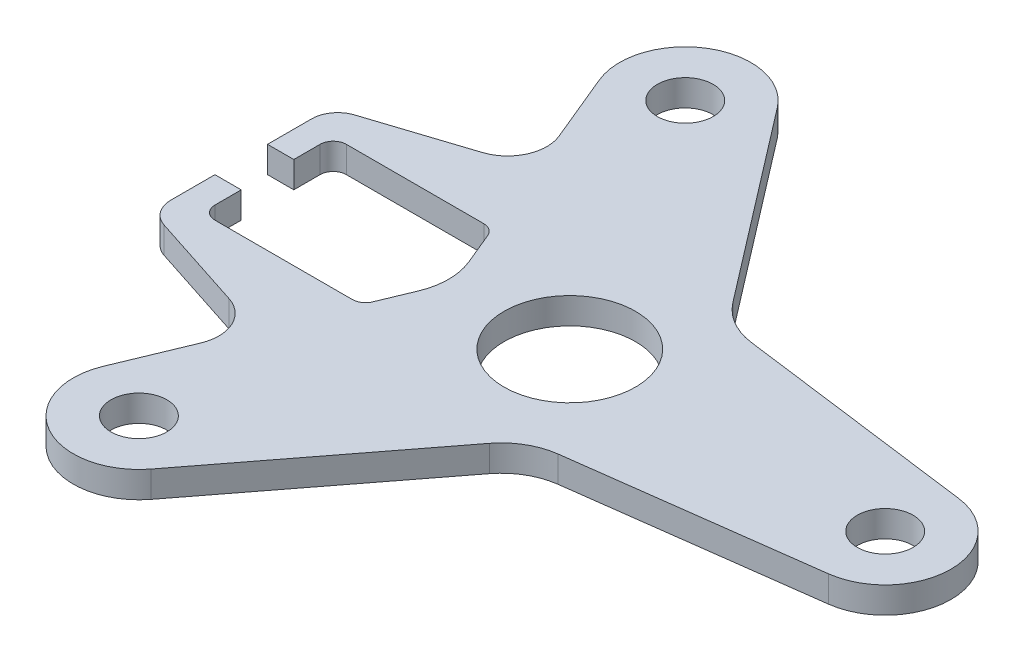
ISO-10303-21;
HEADER;
FILE_DESCRIPTION(('STEP AP214'),'2;1');
FILE_NAME('part.step','',(''),(''),'','','');
FILE_SCHEMA(('AUTOMOTIVE_DESIGN { 1 0 10303 214 1 1 1 1 }'));
ENDSEC;
DATA;
#1=APPLICATION_CONTEXT('core data for automotive mechanical design processes');
#2=APPLICATION_PROTOCOL_DEFINITION('international standard','automotive_design',2000,#1);
#3=PRODUCT_CONTEXT('',#1,'mechanical');
#4=PRODUCT('Part','Part','',(#3));
#5=PRODUCT_RELATED_PRODUCT_CATEGORY('part','',(#4));
#6=PRODUCT_DEFINITION_FORMATION('','',#4);
#7=PRODUCT_DEFINITION_CONTEXT('part definition',#1,'design');
#8=PRODUCT_DEFINITION('design','',#6,#7);
#9=PRODUCT_DEFINITION_SHAPE('','',#8);
#10=(LENGTH_UNIT() NAMED_UNIT(*) SI_UNIT(.MILLI.,.METRE.));
#11=(NAMED_UNIT(*) PLANE_ANGLE_UNIT() SI_UNIT($,.RADIAN.));
#12=(NAMED_UNIT(*) SI_UNIT($,.STERADIAN.) SOLID_ANGLE_UNIT());
#13=UNCERTAINTY_MEASURE_WITH_UNIT(LENGTH_MEASURE(1.E-05),#10,'distance_accuracy_value','');
#14=(GEOMETRIC_REPRESENTATION_CONTEXT(3) GLOBAL_UNCERTAINTY_ASSIGNED_CONTEXT((#13)) GLOBAL_UNIT_ASSIGNED_CONTEXT((#10,
#11,#12)) REPRESENTATION_CONTEXT('',''));
#15=CARTESIAN_POINT('',(0.,0.,0.));
#16=DIRECTION('',(0.,0.,1.));
#17=DIRECTION('',(1.,0.,0.));
#18=AXIS2_PLACEMENT_3D('',#15,#16,#17);
#19=CARTESIAN_POINT('',(7.10732739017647,1.,12.310252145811));
#20=DIRECTION('',(0.,1.,0.));
#21=DIRECTION('',(0.,0.,1.));
#22=AXIS2_PLACEMENT_3D('',#19,#20,#21);
#23=PLANE('',#22);
#24=CARTESIAN_POINT('',(-12.,1.,-20.7846096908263));
#25=DIRECTION('',(0.,1.,0.));
#26=DIRECTION('',(0.,0.,1.));
#27=AXIS2_PLACEMENT_3D('',#24,#25,#26);
#28=CIRCLE('',#27,2.12500000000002);
#29=CARTESIAN_POINT('',(-12.,1.,-18.6596096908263));
#30=VERTEX_POINT('',#29);
#31=EDGE_CURVE('E551',#30,#30,#28,.T.);
#32=ORIENTED_EDGE('',*,*,#31,.F.);
#33=EDGE_LOOP('',(#32));
#34=FACE_BOUND('',#33,.T.);
#35=CARTESIAN_POINT('',(24.,1.,0.));
#36=DIRECTION('',(0.,1.,0.));
#37=DIRECTION('',(0.,0.,1.));
#38=AXIS2_PLACEMENT_3D('',#35,#36,#37);
#39=CIRCLE('',#38,2.125);
#40=CARTESIAN_POINT('',(24.,1.,2.125));
#41=VERTEX_POINT('',#40);
#42=EDGE_CURVE('E277',#41,#41,#39,.T.);
#43=ORIENTED_EDGE('',*,*,#42,.F.);
#44=EDGE_LOOP('',(#43));
#45=FACE_BOUND('',#44,.T.);
#46=CARTESIAN_POINT('',(7.10732739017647,1.,12.310252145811));
#47=DIRECTION('',(0.,-1.,0.));
#48=DIRECTION('',(0.,0.,1.));
#49=AXIS2_PLACEMENT_3D('',#46,#47,#48);
#50=CIRCLE('',#49,5.);
#51=CARTESIAN_POINT('',(3.14056068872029,1.,9.26644500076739));
#52=VERTEX_POINT('',#51);
#53=CARTESIAN_POINT('',(6.45469642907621,1.,7.35302783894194));
#54=VERTEX_POINT('',#53);
#55=EDGE_CURVE('E336',#52,#54,#50,.T.);
#56=ORIENTED_EDGE('',*,*,#55,.T.);
#57=DIRECTION('',(0.99144486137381,0.,-0.130526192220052));
#58=VECTOR('',#57,1.);
#59=CARTESIAN_POINT('',(24.6526309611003,1.,4.95722430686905));
#60=LINE('',#59,#58);
#61=CARTESIAN_POINT('',(24.6526309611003,1.,4.95722430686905));
#62=VERTEX_POINT('',#61);
#63=EDGE_CURVE('E164',#54,#62,#60,.T.);
#64=ORIENTED_EDGE('',*,*,#63,.T.);
#65=CARTESIAN_POINT('',(24.,1.,0.));
#66=DIRECTION('',(0.,1.,0.));
#67=DIRECTION('',(0.,0.,1.));
#68=AXIS2_PLACEMENT_3D('',#65,#66,#67);
#69=CIRCLE('',#68,5.);
#70=CARTESIAN_POINT('',(24.6526309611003,1.,-4.95722430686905));
#71=VERTEX_POINT('',#70);
#72=EDGE_CURVE('E423',#62,#71,#69,.T.);
#73=ORIENTED_EDGE('',*,*,#72,.T.);
#74=DIRECTION('',(-0.99144486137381,0.,-0.130526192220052));
#75=VECTOR('',#74,1.);
#76=CARTESIAN_POINT('',(24.6526309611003,1.,-4.95722430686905));
#77=LINE('',#76,#75);
#78=CARTESIAN_POINT('',(6.45469642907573,1.,-7.353027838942));
#79=VERTEX_POINT('',#78);
#80=EDGE_CURVE('E442',#71,#79,#77,.T.);
#81=ORIENTED_EDGE('',*,*,#80,.T.);
#82=CARTESIAN_POINT('',(7.10732739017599,1.,-12.3102521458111));
#83=DIRECTION('',(0.,-1.,0.));
#84=DIRECTION('',(0.,0.,1.));
#85=AXIS2_PLACEMENT_3D('',#82,#83,#84);
#86=CIRCLE('',#85,5.);
#87=CARTESIAN_POINT('',(3.14056068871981,1.,-9.26644500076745));
#88=VERTEX_POINT('',#87);
#89=EDGE_CURVE('E439',#79,#88,#86,.T.);
#90=ORIENTED_EDGE('',*,*,#89,.T.);
#91=DIRECTION('',(-0.608761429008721,0.,-0.793353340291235));
#92=VECTOR('',#91,1.);
#93=CARTESIAN_POINT('',(-8.03323329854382,1.,-23.8284168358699));
#94=LINE('',#93,#92);
#95=CARTESIAN_POINT('',(-8.03323329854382,1.,-23.8284168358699));
#96=VERTEX_POINT('',#95);
#97=EDGE_CURVE('E441',#88,#96,#94,.T.);
#98=ORIENTED_EDGE('',*,*,#97,.T.);
#99=CARTESIAN_POINT('',(-12.,1.,-20.7846096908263));
#100=DIRECTION('',(0.,1.,0.));
#101=DIRECTION('',(0.,0.,1.));
#102=AXIS2_PLACEMENT_3D('',#99,#100,#101);
#103=CIRCLE('',#102,5.);
#104=CARTESIAN_POINT('',(-16.6193976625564,1.,-18.8711925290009));
#105=VERTEX_POINT('',#104);
#106=EDGE_CURVE('E444',#96,#105,#103,.T.);
#107=ORIENTED_EDGE('',*,*,#106,.T.);
#108=DIRECTION('',(0.382683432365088,0.,0.923879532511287));
#109=VECTOR('',#108,1.);
#110=CARTESIAN_POINT('',(-16.6193976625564,1.,-18.8711925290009));
#111=LINE('',#110,#109);
#112=CARTESIAN_POINT('',(-14.4493554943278,1.,-13.6322472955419));
#113=VERTEX_POINT('',#112);
#114=EDGE_CURVE('E450',#105,#113,#111,.T.);
#115=ORIENTED_EDGE('',*,*,#114,.T.);
#116=CARTESIAN_POINT('',(-17.2209940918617,1.,-12.4841969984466));
#117=DIRECTION('',(0.,-1.,0.));
#118=DIRECTION('',(0.,0.,1.));
#119=AXIS2_PLACEMENT_3D('',#116,#117,#118);
#120=CIRCLE('',#119,3.);
#121=CARTESIAN_POINT('',(-16.2939431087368,1.,-9.63102744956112));
#122=VERTEX_POINT('',#121);
#123=EDGE_CURVE('E452',#113,#122,#120,.T.);
#124=ORIENTED_EDGE('',*,*,#123,.T.);
#125=DIRECTION('',(-0.951056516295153,0.,0.309016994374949));
#126=VECTOR('',#125,1.);
#127=CARTESIAN_POINT('',(-23.6180339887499,1.,-7.25128606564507));
#128=LINE('',#127,#126);
#129=CARTESIAN_POINT('',(-23.6180339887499,1.,-7.25128606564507));
#130=VERTEX_POINT('',#129);
#131=EDGE_CURVE('E454',#122,#130,#128,.T.);
#132=ORIENTED_EDGE('',*,*,#131,.T.);
#133=CARTESIAN_POINT('',(-23.,1.,-5.34917303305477));
#134=DIRECTION('',(0.,1.,0.));
#135=DIRECTION('',(0.,0.,1.));
#136=AXIS2_PLACEMENT_3D('',#133,#134,#135);
#137=CIRCLE('',#136,2.);
#138=CARTESIAN_POINT('',(-25.,1.,-5.34917303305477));
#139=VERTEX_POINT('',#138);
#140=EDGE_CURVE('E456',#130,#139,#137,.T.);
#141=ORIENTED_EDGE('',*,*,#140,.T.);
#142=DIRECTION('',(0.,0.,1.));
#143=VECTOR('',#142,1.);
#144=CARTESIAN_POINT('',(-25.,1.,-5.34917303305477));
#145=LINE('',#144,#143);
#146=CARTESIAN_POINT('',(-25.,1.,-2.));
#147=VERTEX_POINT('',#146);
#148=EDGE_CURVE('E458',#139,#147,#145,.T.);
#149=ORIENTED_EDGE('',*,*,#148,.T.);
#150=DIRECTION('',(1.,0.,0.));
#151=VECTOR('',#150,1.);
#152=CARTESIAN_POINT('',(-25.,1.,-2.));
#153=LINE('',#152,#151);
#154=CARTESIAN_POINT('',(-23.,1.,-2.));
#155=VERTEX_POINT('',#154);
#156=EDGE_CURVE('E460',#147,#155,#153,.T.);
#157=ORIENTED_EDGE('',*,*,#156,.T.);
#158=DIRECTION('',(0.,0.,-1.));
#159=VECTOR('',#158,1.);
#160=CARTESIAN_POINT('',(-23.,1.,-3.99999999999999));
#161=LINE('',#160,#159);
#162=CARTESIAN_POINT('',(-23.,1.,-3.99999999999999));
#163=VERTEX_POINT('',#162);
#164=EDGE_CURVE('E462',#155,#163,#161,.T.);
#165=ORIENTED_EDGE('',*,*,#164,.T.);
#166=CARTESIAN_POINT('',(-22.,1.,-4.));
#167=DIRECTION('',(0.,-1.,0.));
#168=DIRECTION('',(0.,0.,1.));
#169=AXIS2_PLACEMENT_3D('',#166,#167,#168);
#170=CIRCLE('',#169,1.);
#171=CARTESIAN_POINT('',(-22.,1.,-5.));
#172=VERTEX_POINT('',#171);
#173=EDGE_CURVE('E464',#163,#172,#170,.T.);
#174=ORIENTED_EDGE('',*,*,#173,.T.);
#175=DIRECTION('',(1.,0.,0.));
#176=VECTOR('',#175,1.);
#177=CARTESIAN_POINT('',(-22.,1.,-5.));
#178=LINE('',#177,#176);
#179=CARTESIAN_POINT('',(-11.5419402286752,1.,-5.));
#180=VERTEX_POINT('',#179);
#181=EDGE_CURVE('E466',#172,#180,#178,.T.);
#182=ORIENTED_EDGE('',*,*,#181,.T.);
#183=CARTESIAN_POINT('',(-11.5419402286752,1.,-4.));
#184=DIRECTION('',(0.,-1.,0.));
#185=DIRECTION('',(0.,0.,-1.));
#186=AXIS2_PLACEMENT_3D('',#183,#184,#185);
#187=CIRCLE('',#186,1.);
#188=CARTESIAN_POINT('',(-10.6180606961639,1.,-4.38268343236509));
#189=VERTEX_POINT('',#188);
#190=EDGE_CURVE('E468',#180,#189,#187,.T.);
#191=ORIENTED_EDGE('',*,*,#190,.T.);
#192=DIRECTION('',(0.382683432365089,0.,0.923879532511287));
#193=VECTOR('',#192,1.);
#194=CARTESIAN_POINT('',(-10.6180606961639,1.,-4.38268343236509));
#195=LINE('',#194,#193);
#196=CARTESIAN_POINT('',(-9.59525711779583,1.,-1.91341716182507));
#197=VERTEX_POINT('',#196);
#198=EDGE_CURVE('E470',#189,#197,#195,.T.);
#199=ORIENTED_EDGE('',*,*,#198,.T.);
#200=CARTESIAN_POINT('',(-14.2146547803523,1.,3.85108611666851E-13));
#201=DIRECTION('',(0.,-1.,0.));
#202=DIRECTION('',(0.,0.,1.));
#203=AXIS2_PLACEMENT_3D('',#200,#201,#202);
#204=CIRCLE('',#203,5.);
#205=CARTESIAN_POINT('',(-9.59525711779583,1.,1.91341716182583));
#206=VERTEX_POINT('',#205);
#207=EDGE_CURVE('E472',#197,#206,#204,.T.);
#208=ORIENTED_EDGE('',*,*,#207,.T.);
#209=DIRECTION('',(-0.382683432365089,0.,0.923879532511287));
#210=VECTOR('',#209,1.);
#211=CARTESIAN_POINT('',(-10.6180606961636,1.,4.38268343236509));
#212=LINE('',#211,#210);
#213=CARTESIAN_POINT('',(-10.6180606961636,1.,4.38268343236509));
#214=VERTEX_POINT('',#213);
#215=EDGE_CURVE('E474',#206,#214,#212,.T.);
#216=ORIENTED_EDGE('',*,*,#215,.T.);
#217=CARTESIAN_POINT('',(-11.5419402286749,1.,4.));
#218=DIRECTION('',(0.,-1.,0.));
#219=DIRECTION('',(0.,0.,-1.));
#220=AXIS2_PLACEMENT_3D('',#217,#218,#219);
#221=CIRCLE('',#220,1.);
#222=CARTESIAN_POINT('',(-11.5419402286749,1.,5.));
#223=VERTEX_POINT('',#222);
#224=EDGE_CURVE('E476',#214,#223,#221,.T.);
#225=ORIENTED_EDGE('',*,*,#224,.T.);
#226=DIRECTION('',(-1.,0.,0.));
#227=VECTOR('',#226,1.);
#228=CARTESIAN_POINT('',(-22.,1.,5.));
#229=LINE('',#228,#227);
#230=CARTESIAN_POINT('',(-22.,1.,5.));
#231=VERTEX_POINT('',#230);
#232=EDGE_CURVE('E478',#223,#231,#229,.T.);
#233=ORIENTED_EDGE('',*,*,#232,.T.);
#234=CARTESIAN_POINT('',(-22.,1.,4.));
#235=DIRECTION('',(0.,-1.,0.));
#236=DIRECTION('',(0.,0.,-1.));
#237=AXIS2_PLACEMENT_3D('',#234,#235,#236);
#238=CIRCLE('',#237,1.);
#239=CARTESIAN_POINT('',(-23.,1.,3.99999999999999));
#240=VERTEX_POINT('',#239);
#241=EDGE_CURVE('E480',#231,#240,#238,.T.);
#242=ORIENTED_EDGE('',*,*,#241,.T.);
#243=DIRECTION('',(0.,0.,-1.));
#244=VECTOR('',#243,1.);
#245=CARTESIAN_POINT('',(-23.,1.,2.));
#246=LINE('',#245,#244);
#247=CARTESIAN_POINT('',(-23.,1.,2.));
#248=VERTEX_POINT('',#247);
#249=EDGE_CURVE('E482',#240,#248,#246,.T.);
#250=ORIENTED_EDGE('',*,*,#249,.T.);
#251=DIRECTION('',(-1.,0.,0.));
#252=VECTOR('',#251,1.);
#253=CARTESIAN_POINT('',(-25.,1.,2.));
#254=LINE('',#253,#252);
#255=CARTESIAN_POINT('',(-25.,1.,2.));
#256=VERTEX_POINT('',#255);
#257=EDGE_CURVE('E484',#248,#256,#254,.T.);
#258=ORIENTED_EDGE('',*,*,#257,.T.);
#259=DIRECTION('',(0.,0.,1.));
#260=VECTOR('',#259,1.);
#261=CARTESIAN_POINT('',(-25.,1.,2.));
#262=LINE('',#261,#260);
#263=CARTESIAN_POINT('',(-25.,1.,5.34917303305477));
#264=VERTEX_POINT('',#263);
#265=EDGE_CURVE('E486',#256,#264,#262,.T.);
#266=ORIENTED_EDGE('',*,*,#265,.T.);
#267=CARTESIAN_POINT('',(-23.,1.,5.34917303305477));
#268=DIRECTION('',(0.,1.,0.));
#269=DIRECTION('',(0.,0.,-1.));
#270=AXIS2_PLACEMENT_3D('',#267,#268,#269);
#271=CIRCLE('',#270,2.);
#272=CARTESIAN_POINT('',(-23.6180339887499,1.,7.25128606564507));
#273=VERTEX_POINT('',#272);
#274=EDGE_CURVE('E488',#264,#273,#271,.T.);
#275=ORIENTED_EDGE('',*,*,#274,.T.);
#276=DIRECTION('',(0.951056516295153,0.,0.309016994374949));
#277=VECTOR('',#276,1.);
#278=CARTESIAN_POINT('',(-23.6180339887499,1.,7.25128606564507));
#279=LINE('',#278,#277);
#280=CARTESIAN_POINT('',(-16.2939431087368,1.,9.63102744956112));
#281=VERTEX_POINT('',#280);
#282=EDGE_CURVE('E490',#273,#281,#279,.T.);
#283=ORIENTED_EDGE('',*,*,#282,.T.);
#284=CARTESIAN_POINT('',(-17.2209940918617,1.,12.4841969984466));
#285=DIRECTION('',(0.,-1.,0.));
#286=DIRECTION('',(0.,0.,-1.));
#287=AXIS2_PLACEMENT_3D('',#284,#285,#286);
#288=CIRCLE('',#287,3.);
#289=CARTESIAN_POINT('',(-14.4493554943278,1.,13.6322472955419));
#290=VERTEX_POINT('',#289);
#291=EDGE_CURVE('E255',#281,#290,#288,.T.);
#292=ORIENTED_EDGE('',*,*,#291,.T.);
#293=DIRECTION('',(-0.382683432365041,0.,0.923879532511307));
#294=VECTOR('',#293,1.);
#295=CARTESIAN_POINT('',(-16.6193976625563,1.,18.8711925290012));
#296=LINE('',#295,#294);
#297=CARTESIAN_POINT('',(-16.6193976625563,1.,18.8711925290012));
#298=VERTEX_POINT('',#297);
#299=EDGE_CURVE('E249',#290,#298,#296,.T.);
#300=ORIENTED_EDGE('',*,*,#299,.T.);
#301=CARTESIAN_POINT('',(-11.9999999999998,1.,20.7846096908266));
#302=DIRECTION('',(0.,1.,0.));
#303=DIRECTION('',(0.,0.,1.));
#304=AXIS2_PLACEMENT_3D('',#301,#302,#303);
#305=CIRCLE('',#304,5.);
#306=CARTESIAN_POINT('',(-8.03323329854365,1.,23.8284168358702));
#307=VERTEX_POINT('',#306);
#308=EDGE_CURVE('E253',#298,#307,#305,.T.);
#309=ORIENTED_EDGE('',*,*,#308,.T.);
#310=DIRECTION('',(0.608761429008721,0.,-0.793353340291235));
#311=VECTOR('',#310,1.);
#312=CARTESIAN_POINT('',(-8.03323329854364,1.,23.8284168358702));
#313=LINE('',#312,#311);
#314=EDGE_CURVE('E49',#307,#52,#313,.T.);
#315=ORIENTED_EDGE('',*,*,#314,.T.);
#316=EDGE_LOOP('',(#56,#64,#73,#81,#90,#98,#107,#115,#124,#132,#141,#149,#157,#165,#174,#182,
#191,#199,#208,#216,#225,#233,#242,#250,#258,#266,#275,#283,#292,#300,#309,#315));
#317=FACE_BOUND('',#316,.T.);
#318=CARTESIAN_POINT('',(-11.9999999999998,1.,20.7846096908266));
#319=DIRECTION('',(0.,1.,0.));
#320=DIRECTION('',(0.,0.,1.));
#321=AXIS2_PLACEMENT_3D('',#318,#319,#320);
#322=CIRCLE('',#321,2.125);
#323=CARTESIAN_POINT('',(-11.9999999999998,1.,22.9096096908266));
#324=VERTEX_POINT('',#323);
#325=EDGE_CURVE('E557',#324,#324,#322,.T.);
#326=ORIENTED_EDGE('',*,*,#325,.F.);
#327=EDGE_LOOP('',(#326));
#328=FACE_BOUND('',#327,.T.);
#329=CARTESIAN_POINT('',(0.,1.,0.));
#330=DIRECTION('',(0.,1.,0.));
#331=DIRECTION('',(0.,0.,1.));
#332=AXIS2_PLACEMENT_3D('',#329,#330,#331);
#333=CIRCLE('',#332,5.);
#334=CARTESIAN_POINT('',(0.,1.,5.));
#335=VERTEX_POINT('',#334);
#336=EDGE_CURVE('E542',#335,#335,#333,.T.);
#337=ORIENTED_EDGE('',*,*,#336,.F.);
#338=EDGE_LOOP('',(#337));
#339=FACE_BOUND('',#338,.T.);
#340=ADVANCED_FACE('F32',(#34,#45,#317,#328,#339),#23,.T.);
#341=CARTESIAN_POINT('',(7.10732739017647,-1.,12.310252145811));
#342=DIRECTION('',(0.,1.,0.));
#343=DIRECTION('',(0.,0.,1.));
#344=AXIS2_PLACEMENT_3D('',#341,#342,#343);
#345=PLANE('',#344);
#346=CARTESIAN_POINT('',(-12.,-1.,-20.7846096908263));
#347=DIRECTION('',(0.,1.,0.));
#348=DIRECTION('',(0.,0.,1.));
#349=AXIS2_PLACEMENT_3D('',#346,#347,#348);
#350=CIRCLE('',#349,2.12500000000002);
#351=CARTESIAN_POINT('',(-12.,-1.,-18.6596096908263));
#352=VERTEX_POINT('',#351);
#353=EDGE_CURVE('E548',#352,#352,#350,.T.);
#354=ORIENTED_EDGE('',*,*,#353,.T.);
#355=EDGE_LOOP('',(#354));
#356=FACE_BOUND('',#355,.T.);
#357=CARTESIAN_POINT('',(24.,-1.,0.));
#358=DIRECTION('',(0.,1.,0.));
#359=DIRECTION('',(0.,0.,1.));
#360=AXIS2_PLACEMENT_3D('',#357,#358,#359);
#361=CIRCLE('',#360,2.125);
#362=CARTESIAN_POINT('',(24.,-1.,2.125));
#363=VERTEX_POINT('',#362);
#364=EDGE_CURVE('E560',#363,#363,#361,.T.);
#365=ORIENTED_EDGE('',*,*,#364,.T.);
#366=EDGE_LOOP('',(#365));
#367=FACE_BOUND('',#366,.T.);
#368=CARTESIAN_POINT('',(7.10732739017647,-1.,12.310252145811));
#369=DIRECTION('',(0.,-1.,0.));
#370=DIRECTION('',(0.,0.,1.));
#371=AXIS2_PLACEMENT_3D('',#368,#369,#370);
#372=CIRCLE('',#371,5.);
#373=CARTESIAN_POINT('',(3.14056068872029,-1.,9.26644500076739));
#374=VERTEX_POINT('',#373);
#375=CARTESIAN_POINT('',(6.45469642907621,-1.,7.35302783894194));
#376=VERTEX_POINT('',#375);
#377=EDGE_CURVE('E273',#374,#376,#372,.T.);
#378=ORIENTED_EDGE('',*,*,#377,.F.);
#379=DIRECTION('',(0.608761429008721,0.,-0.793353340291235));
#380=VECTOR('',#379,1.);
#381=CARTESIAN_POINT('',(-8.03323329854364,-1.,23.8284168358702));
#382=LINE('',#381,#380);
#383=CARTESIAN_POINT('',(-8.03323329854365,-1.,23.8284168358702));
#384=VERTEX_POINT('',#383);
#385=EDGE_CURVE('E156',#384,#374,#382,.T.);
#386=ORIENTED_EDGE('',*,*,#385,.F.);
#387=CARTESIAN_POINT('',(-11.9999999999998,-1.,20.7846096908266));
#388=DIRECTION('',(0.,1.,0.));
#389=DIRECTION('',(0.,0.,1.));
#390=AXIS2_PLACEMENT_3D('',#387,#388,#389);
#391=CIRCLE('',#390,5.);
#392=CARTESIAN_POINT('',(-16.6193976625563,-1.,18.8711925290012));
#393=VERTEX_POINT('',#392);
#394=EDGE_CURVE('E150',#393,#384,#391,.T.);
#395=ORIENTED_EDGE('',*,*,#394,.F.);
#396=DIRECTION('',(-0.382683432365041,0.,0.923879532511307));
#397=VECTOR('',#396,1.);
#398=CARTESIAN_POINT('',(-16.6193976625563,-1.,18.8711925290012));
#399=LINE('',#398,#397);
#400=CARTESIAN_POINT('',(-14.4493554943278,-1.,13.6322472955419));
#401=VERTEX_POINT('',#400);
#402=EDGE_CURVE('E263',#401,#393,#399,.T.);
#403=ORIENTED_EDGE('',*,*,#402,.F.);
#404=CARTESIAN_POINT('',(-17.2209940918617,-1.,12.4841969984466));
#405=DIRECTION('',(0.,-1.,0.));
#406=DIRECTION('',(0.,0.,-1.));
#407=AXIS2_PLACEMENT_3D('',#404,#405,#406);
#408=CIRCLE('',#407,3.);
#409=CARTESIAN_POINT('',(-16.2939431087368,-1.,9.63102744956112));
#410=VERTEX_POINT('',#409);
#411=EDGE_CURVE('E331',#410,#401,#408,.T.);
#412=ORIENTED_EDGE('',*,*,#411,.F.);
#413=DIRECTION('',(0.951056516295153,0.,0.309016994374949));
#414=VECTOR('',#413,1.);
#415=CARTESIAN_POINT('',(-23.6180339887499,-1.,7.25128606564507));
#416=LINE('',#415,#414);
#417=CARTESIAN_POINT('',(-23.6180339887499,-1.,7.25128606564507));
#418=VERTEX_POINT('',#417);
#419=EDGE_CURVE('E329',#418,#410,#416,.T.);
#420=ORIENTED_EDGE('',*,*,#419,.F.);
#421=CARTESIAN_POINT('',(-23.,-1.,5.34917303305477));
#422=DIRECTION('',(0.,1.,0.));
#423=DIRECTION('',(0.,0.,-1.));
#424=AXIS2_PLACEMENT_3D('',#421,#422,#423);
#425=CIRCLE('',#424,2.);
#426=CARTESIAN_POINT('',(-25.,-1.,5.34917303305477));
#427=VERTEX_POINT('',#426);
#428=EDGE_CURVE('E327',#427,#418,#425,.T.);
#429=ORIENTED_EDGE('',*,*,#428,.F.);
#430=DIRECTION('',(0.,0.,1.));
#431=VECTOR('',#430,1.);
#432=CARTESIAN_POINT('',(-25.,-1.,2.));
#433=LINE('',#432,#431);
#434=CARTESIAN_POINT('',(-25.,-1.,2.));
#435=VERTEX_POINT('',#434);
#436=EDGE_CURVE('E325',#435,#427,#433,.T.);
#437=ORIENTED_EDGE('',*,*,#436,.F.);
#438=DIRECTION('',(-1.,0.,0.));
#439=VECTOR('',#438,1.);
#440=CARTESIAN_POINT('',(-25.,-1.,2.));
#441=LINE('',#440,#439);
#442=CARTESIAN_POINT('',(-23.,-1.,2.));
#443=VERTEX_POINT('',#442);
#444=EDGE_CURVE('E323',#443,#435,#441,.T.);
#445=ORIENTED_EDGE('',*,*,#444,.F.);
#446=DIRECTION('',(0.,0.,-1.));
#447=VECTOR('',#446,1.);
#448=CARTESIAN_POINT('',(-23.,-1.,2.));
#449=LINE('',#448,#447);
#450=CARTESIAN_POINT('',(-23.,-1.,3.99999999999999));
#451=VERTEX_POINT('',#450);
#452=EDGE_CURVE('E321',#451,#443,#449,.T.);
#453=ORIENTED_EDGE('',*,*,#452,.F.);
#454=CARTESIAN_POINT('',(-22.,-1.,4.));
#455=DIRECTION('',(0.,-1.,0.));
#456=DIRECTION('',(0.,0.,-1.));
#457=AXIS2_PLACEMENT_3D('',#454,#455,#456);
#458=CIRCLE('',#457,1.);
#459=CARTESIAN_POINT('',(-22.,-1.,5.));
#460=VERTEX_POINT('',#459);
#461=EDGE_CURVE('E319',#460,#451,#458,.T.);
#462=ORIENTED_EDGE('',*,*,#461,.F.);
#463=DIRECTION('',(-1.,0.,0.));
#464=VECTOR('',#463,1.);
#465=CARTESIAN_POINT('',(-22.,-1.,5.));
#466=LINE('',#465,#464);
#467=CARTESIAN_POINT('',(-11.5419402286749,-1.,5.));
#468=VERTEX_POINT('',#467);
#469=EDGE_CURVE('E317',#468,#460,#466,.T.);
#470=ORIENTED_EDGE('',*,*,#469,.F.);
#471=CARTESIAN_POINT('',(-11.5419402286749,-1.,4.));
#472=DIRECTION('',(0.,-1.,0.));
#473=DIRECTION('',(0.,0.,-1.));
#474=AXIS2_PLACEMENT_3D('',#471,#472,#473);
#475=CIRCLE('',#474,1.);
#476=CARTESIAN_POINT('',(-10.6180606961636,-1.,4.38268343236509));
#477=VERTEX_POINT('',#476);
#478=EDGE_CURVE('E315',#477,#468,#475,.T.);
#479=ORIENTED_EDGE('',*,*,#478,.F.);
#480=DIRECTION('',(-0.382683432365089,0.,0.923879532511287));
#481=VECTOR('',#480,1.);
#482=CARTESIAN_POINT('',(-10.6180606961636,-1.,4.38268343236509));
#483=LINE('',#482,#481);
#484=CARTESIAN_POINT('',(-9.59525711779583,-1.,1.91341716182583));
#485=VERTEX_POINT('',#484);
#486=EDGE_CURVE('E313',#485,#477,#483,.T.);
#487=ORIENTED_EDGE('',*,*,#486,.F.);
#488=CARTESIAN_POINT('',(-14.2146547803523,-1.,3.85108611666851E-13));
#489=DIRECTION('',(0.,-1.,0.));
#490=DIRECTION('',(0.,0.,1.));
#491=AXIS2_PLACEMENT_3D('',#488,#489,#490);
#492=CIRCLE('',#491,5.);
#493=CARTESIAN_POINT('',(-9.59525711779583,-1.,-1.91341716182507));
#494=VERTEX_POINT('',#493);
#495=EDGE_CURVE('E311',#494,#485,#492,.T.);
#496=ORIENTED_EDGE('',*,*,#495,.F.);
#497=DIRECTION('',(0.382683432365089,0.,0.923879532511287));
#498=VECTOR('',#497,1.);
#499=CARTESIAN_POINT('',(-10.6180606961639,-1.,-4.38268343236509));
#500=LINE('',#499,#498);
#501=CARTESIAN_POINT('',(-10.6180606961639,-1.,-4.38268343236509));
#502=VERTEX_POINT('',#501);
#503=EDGE_CURVE('E309',#502,#494,#500,.T.);
#504=ORIENTED_EDGE('',*,*,#503,.F.);
#505=CARTESIAN_POINT('',(-11.5419402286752,-1.,-4.));
#506=DIRECTION('',(0.,-1.,0.));
#507=DIRECTION('',(0.,0.,-1.));
#508=AXIS2_PLACEMENT_3D('',#505,#506,#507);
#509=CIRCLE('',#508,1.);
#510=CARTESIAN_POINT('',(-11.5419402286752,-1.,-5.));
#511=VERTEX_POINT('',#510);
#512=EDGE_CURVE('E307',#511,#502,#509,.T.);
#513=ORIENTED_EDGE('',*,*,#512,.F.);
#514=DIRECTION('',(1.,0.,0.));
#515=VECTOR('',#514,1.);
#516=CARTESIAN_POINT('',(-22.,-1.,-5.));
#517=LINE('',#516,#515);
#518=CARTESIAN_POINT('',(-22.,-1.,-5.));
#519=VERTEX_POINT('',#518);
#520=EDGE_CURVE('E305',#519,#511,#517,.T.);
#521=ORIENTED_EDGE('',*,*,#520,.F.);
#522=CARTESIAN_POINT('',(-22.,-1.,-4.));
#523=DIRECTION('',(0.,-1.,0.));
#524=DIRECTION('',(0.,0.,1.));
#525=AXIS2_PLACEMENT_3D('',#522,#523,#524);
#526=CIRCLE('',#525,1.);
#527=CARTESIAN_POINT('',(-23.,-1.,-3.99999999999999));
#528=VERTEX_POINT('',#527);
#529=EDGE_CURVE('E303',#528,#519,#526,.T.);
#530=ORIENTED_EDGE('',*,*,#529,.F.);
#531=DIRECTION('',(0.,0.,-1.));
#532=VECTOR('',#531,1.);
#533=CARTESIAN_POINT('',(-23.,-1.,-3.99999999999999));
#534=LINE('',#533,#532);
#535=CARTESIAN_POINT('',(-23.,-1.,-2.));
#536=VERTEX_POINT('',#535);
#537=EDGE_CURVE('E301',#536,#528,#534,.T.);
#538=ORIENTED_EDGE('',*,*,#537,.F.);
#539=DIRECTION('',(1.,0.,0.));
#540=VECTOR('',#539,1.);
#541=CARTESIAN_POINT('',(-25.,-1.,-2.));
#542=LINE('',#541,#540);
#543=CARTESIAN_POINT('',(-25.,-1.,-2.));
#544=VERTEX_POINT('',#543);
#545=EDGE_CURVE('E299',#544,#536,#542,.T.);
#546=ORIENTED_EDGE('',*,*,#545,.F.);
#547=DIRECTION('',(0.,0.,1.));
#548=VECTOR('',#547,1.);
#549=CARTESIAN_POINT('',(-25.,-1.,-5.34917303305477));
#550=LINE('',#549,#548);
#551=CARTESIAN_POINT('',(-25.,-1.,-5.34917303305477));
#552=VERTEX_POINT('',#551);
#553=EDGE_CURVE('E297',#552,#544,#550,.T.);
#554=ORIENTED_EDGE('',*,*,#553,.F.);
#555=CARTESIAN_POINT('',(-23.,-1.,-5.34917303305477));
#556=DIRECTION('',(0.,1.,0.));
#557=DIRECTION('',(0.,0.,1.));
#558=AXIS2_PLACEMENT_3D('',#555,#556,#557);
#559=CIRCLE('',#558,2.);
#560=CARTESIAN_POINT('',(-23.6180339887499,-1.,-7.25128606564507));
#561=VERTEX_POINT('',#560);
#562=EDGE_CURVE('E295',#561,#552,#559,.T.);
#563=ORIENTED_EDGE('',*,*,#562,.F.);
#564=DIRECTION('',(-0.951056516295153,0.,0.309016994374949));
#565=VECTOR('',#564,1.);
#566=CARTESIAN_POINT('',(-23.6180339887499,-1.,-7.25128606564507));
#567=LINE('',#566,#565);
#568=CARTESIAN_POINT('',(-16.2939431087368,-1.,-9.63102744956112));
#569=VERTEX_POINT('',#568);
#570=EDGE_CURVE('E293',#569,#561,#567,.T.);
#571=ORIENTED_EDGE('',*,*,#570,.F.);
#572=CARTESIAN_POINT('',(-17.2209940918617,-1.,-12.4841969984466));
#573=DIRECTION('',(0.,-1.,0.));
#574=DIRECTION('',(0.,0.,1.));
#575=AXIS2_PLACEMENT_3D('',#572,#573,#574);
#576=CIRCLE('',#575,3.);
#577=CARTESIAN_POINT('',(-14.4493554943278,-1.,-13.6322472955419));
#578=VERTEX_POINT('',#577);
#579=EDGE_CURVE('E291',#578,#569,#576,.T.);
#580=ORIENTED_EDGE('',*,*,#579,.F.);
#581=DIRECTION('',(0.382683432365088,0.,0.923879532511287));
#582=VECTOR('',#581,1.);
#583=CARTESIAN_POINT('',(-16.6193976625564,-1.,-18.8711925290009));
#584=LINE('',#583,#582);
#585=CARTESIAN_POINT('',(-16.6193976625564,-1.,-18.8711925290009));
#586=VERTEX_POINT('',#585);
#587=EDGE_CURVE('E289',#586,#578,#584,.T.);
#588=ORIENTED_EDGE('',*,*,#587,.F.);
#589=CARTESIAN_POINT('',(-12.,-1.,-20.7846096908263));
#590=DIRECTION('',(0.,1.,0.));
#591=DIRECTION('',(0.,0.,1.));
#592=AXIS2_PLACEMENT_3D('',#589,#590,#591);
#593=CIRCLE('',#592,5.);
#594=CARTESIAN_POINT('',(-8.03323329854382,-1.,-23.8284168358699));
#595=VERTEX_POINT('',#594);
#596=EDGE_CURVE('E287',#595,#586,#593,.T.);
#597=ORIENTED_EDGE('',*,*,#596,.F.);
#598=DIRECTION('',(-0.608761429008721,0.,-0.793353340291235));
#599=VECTOR('',#598,1.);
#600=CARTESIAN_POINT('',(-8.03323329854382,-1.,-23.8284168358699));
#601=LINE('',#600,#599);
#602=CARTESIAN_POINT('',(3.14056068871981,-1.,-9.26644500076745));
#603=VERTEX_POINT('',#602);
#604=EDGE_CURVE('E285',#603,#595,#601,.T.);
#605=ORIENTED_EDGE('',*,*,#604,.F.);
#606=CARTESIAN_POINT('',(7.10732739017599,-1.,-12.3102521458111));
#607=DIRECTION('',(0.,-1.,0.));
#608=DIRECTION('',(0.,0.,1.));
#609=AXIS2_PLACEMENT_3D('',#606,#607,#608);
#610=CIRCLE('',#609,5.);
#611=CARTESIAN_POINT('',(6.45469642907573,-1.,-7.353027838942));
#612=VERTEX_POINT('',#611);
#613=EDGE_CURVE('E283',#612,#603,#610,.T.);
#614=ORIENTED_EDGE('',*,*,#613,.F.);
#615=DIRECTION('',(-0.99144486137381,0.,-0.130526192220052));
#616=VECTOR('',#615,1.);
#617=CARTESIAN_POINT('',(24.6526309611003,-1.,-4.95722430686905));
#618=LINE('',#617,#616);
#619=CARTESIAN_POINT('',(24.6526309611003,-1.,-4.95722430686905));
#620=VERTEX_POINT('',#619);
#621=EDGE_CURVE('E281',#620,#612,#618,.T.);
#622=ORIENTED_EDGE('',*,*,#621,.F.);
#623=CARTESIAN_POINT('',(24.,-1.,0.));
#624=DIRECTION('',(0.,1.,0.));
#625=DIRECTION('',(0.,0.,1.));
#626=AXIS2_PLACEMENT_3D('',#623,#624,#625);
#627=CIRCLE('',#626,5.);
#628=CARTESIAN_POINT('',(24.6526309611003,-1.,4.95722430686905));
#629=VERTEX_POINT('',#628);
#630=EDGE_CURVE('E279',#629,#620,#627,.T.);
#631=ORIENTED_EDGE('',*,*,#630,.F.);
#632=DIRECTION('',(0.99144486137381,0.,-0.130526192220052));
#633=VECTOR('',#632,1.);
#634=CARTESIAN_POINT('',(24.6526309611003,-1.,4.95722430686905));
#635=LINE('',#634,#633);
#636=EDGE_CURVE('E276',#376,#629,#635,.T.);
#637=ORIENTED_EDGE('',*,*,#636,.F.);
#638=EDGE_LOOP('',(#378,#386,#395,#403,#412,#420,#429,#437,#445,#453,#462,#470,#479,#487,#496,
#504,#513,#521,#530,#538,#546,#554,#563,#571,#580,#588,#597,#605,#614,#622,#631,#637));
#639=FACE_BOUND('',#638,.T.);
#640=CARTESIAN_POINT('',(-11.9999999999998,-1.,20.7846096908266));
#641=DIRECTION('',(0.,1.,0.));
#642=DIRECTION('',(0.,0.,1.));
#643=AXIS2_PLACEMENT_3D('',#640,#641,#642);
#644=CIRCLE('',#643,2.125);
#645=CARTESIAN_POINT('',(-11.9999999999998,-1.,22.9096096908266));
#646=VERTEX_POINT('',#645);
#647=EDGE_CURVE('E554',#646,#646,#644,.T.);
#648=ORIENTED_EDGE('',*,*,#647,.T.);
#649=EDGE_LOOP('',(#648));
#650=FACE_BOUND('',#649,.T.);
#651=CARTESIAN_POINT('',(0.,-1.,0.));
#652=DIRECTION('',(0.,1.,0.));
#653=DIRECTION('',(0.,0.,1.));
#654=AXIS2_PLACEMENT_3D('',#651,#652,#653);
#655=CIRCLE('',#654,5.);
#656=CARTESIAN_POINT('',(0.,-1.,5.));
#657=VERTEX_POINT('',#656);
#658=EDGE_CURVE('E545',#657,#657,#655,.T.);
#659=ORIENTED_EDGE('',*,*,#658,.T.);
#660=EDGE_LOOP('',(#659));
#661=FACE_BOUND('',#660,.T.);
#662=ADVANCED_FACE('F427',(#356,#367,#639,#650,#661),#345,.F.);
#663=CARTESIAN_POINT('',(7.10732739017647,1.,12.310252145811));
#664=DIRECTION('',(0.,-1.,0.));
#665=DIRECTION('',(0.,0.,-1.));
#666=AXIS2_PLACEMENT_3D('',#663,#664,#665);
#667=CYLINDRICAL_SURFACE('',#666,5.);
#668=ORIENTED_EDGE('',*,*,#377,.T.);
#669=DIRECTION('',(0.,-1.,0.));
#670=VECTOR('',#669,1.);
#671=CARTESIAN_POINT('',(6.45469642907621,1.,7.35302783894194));
#672=LINE('',#671,#670);
#673=EDGE_CURVE('E11',#54,#376,#672,.T.);
#674=ORIENTED_EDGE('',*,*,#673,.F.);
#675=ORIENTED_EDGE('',*,*,#55,.F.);
#676=DIRECTION('',(0.,-1.,0.));
#677=VECTOR('',#676,1.);
#678=CARTESIAN_POINT('',(3.14056068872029,1.,9.26644500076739));
#679=LINE('',#678,#677);
#680=EDGE_CURVE('E269',#52,#374,#679,.T.);
#681=ORIENTED_EDGE('',*,*,#680,.T.);
#682=EDGE_LOOP('',(#668,#674,#675,#681));
#683=FACE_BOUND('',#682,.T.);
#684=ADVANCED_FACE('F34',(#683),#667,.F.);
#685=CARTESIAN_POINT('',(24.6526309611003,1.,4.95722430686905));
#686=DIRECTION('',(-0.130526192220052,0.,-0.99144486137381));
#687=DIRECTION('',(-0.99144486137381,0.,0.130526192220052));
#688=AXIS2_PLACEMENT_3D('',#685,#686,#687);
#689=PLANE('',#688);
#690=ORIENTED_EDGE('',*,*,#636,.T.);
#691=DIRECTION('',(0.,-1.,0.));
#692=VECTOR('',#691,1.);
#693=CARTESIAN_POINT('',(24.6526309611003,1.,4.95722430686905));
#694=LINE('',#693,#692);
#695=EDGE_CURVE('E41',#62,#629,#694,.T.);
#696=ORIENTED_EDGE('',*,*,#695,.F.);
#697=ORIENTED_EDGE('',*,*,#63,.F.);
#698=ORIENTED_EDGE('',*,*,#673,.T.);
#699=EDGE_LOOP('',(#690,#696,#697,#698));
#700=FACE_BOUND('',#699,.T.);
#701=ADVANCED_FACE('F869',(#700),#689,.F.);
#702=CARTESIAN_POINT('',(24.,1.,0.));
#703=DIRECTION('',(0.,-1.,0.));
#704=DIRECTION('',(0.,0.,-1.));
#705=AXIS2_PLACEMENT_3D('',#702,#703,#704);
#706=CYLINDRICAL_SURFACE('',#705,5.);
#707=ORIENTED_EDGE('',*,*,#630,.T.);
#708=DIRECTION('',(0.,-1.,0.));
#709=VECTOR('',#708,1.);
#710=CARTESIAN_POINT('',(24.6526309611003,1.,-4.95722430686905));
#711=LINE('',#710,#709);
#712=EDGE_CURVE('E415',#71,#620,#711,.T.);
#713=ORIENTED_EDGE('',*,*,#712,.F.);
#714=ORIENTED_EDGE('',*,*,#72,.F.);
#715=ORIENTED_EDGE('',*,*,#695,.T.);
#716=EDGE_LOOP('',(#707,#713,#714,#715));
#717=FACE_BOUND('',#716,.T.);
#718=ADVANCED_FACE('F421',(#717),#706,.T.);
#719=CARTESIAN_POINT('',(24.6526309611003,1.,-4.95722430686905));
#720=DIRECTION('',(-0.130526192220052,0.,0.99144486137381));
#721=DIRECTION('',(0.99144486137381,0.,0.130526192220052));
#722=AXIS2_PLACEMENT_3D('',#719,#720,#721);
#723=PLANE('',#722);
#724=ORIENTED_EDGE('',*,*,#621,.T.);
#725=DIRECTION('',(0.,-1.,0.));
#726=VECTOR('',#725,1.);
#727=CARTESIAN_POINT('',(6.45469642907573,1.,-7.353027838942));
#728=LINE('',#727,#726);
#729=EDGE_CURVE('E412',#79,#612,#728,.T.);
#730=ORIENTED_EDGE('',*,*,#729,.F.);
#731=ORIENTED_EDGE('',*,*,#80,.F.);
#732=ORIENTED_EDGE('',*,*,#712,.T.);
#733=EDGE_LOOP('',(#724,#730,#731,#732));
#734=FACE_BOUND('',#733,.T.);
#735=ADVANCED_FACE('F433',(#734),#723,.F.);
#736=CARTESIAN_POINT('',(7.10732739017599,1.,-12.3102521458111));
#737=DIRECTION('',(0.,-1.,0.));
#738=DIRECTION('',(0.,0.,-1.));
#739=AXIS2_PLACEMENT_3D('',#736,#737,#738);
#740=CYLINDRICAL_SURFACE('',#739,5.);
#741=ORIENTED_EDGE('',*,*,#613,.T.);
#742=DIRECTION('',(0.,-1.,0.));
#743=VECTOR('',#742,1.);
#744=CARTESIAN_POINT('',(3.14056068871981,1.,-9.26644500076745));
#745=LINE('',#744,#743);
#746=EDGE_CURVE('E409',#88,#603,#745,.T.);
#747=ORIENTED_EDGE('',*,*,#746,.F.);
#748=ORIENTED_EDGE('',*,*,#89,.F.);
#749=ORIENTED_EDGE('',*,*,#729,.T.);
#750=EDGE_LOOP('',(#741,#747,#748,#749));
#751=FACE_BOUND('',#750,.T.);
#752=ADVANCED_FACE('F437',(#751),#740,.F.);
#753=CARTESIAN_POINT('',(-8.03323329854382,1.,-23.8284168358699));
#754=DIRECTION('',(-0.793353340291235,0.,0.608761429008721));
#755=DIRECTION('',(0.608761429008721,0.,0.793353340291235));
#756=AXIS2_PLACEMENT_3D('',#753,#754,#755);
#757=PLANE('',#756);
#758=ORIENTED_EDGE('',*,*,#604,.T.);
#759=DIRECTION('',(0.,-1.,0.));
#760=VECTOR('',#759,1.);
#761=CARTESIAN_POINT('',(-8.03323329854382,1.,-23.8284168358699));
#762=LINE('',#761,#760);
#763=EDGE_CURVE('E406',#96,#595,#762,.T.);
#764=ORIENTED_EDGE('',*,*,#763,.F.);
#765=ORIENTED_EDGE('',*,*,#97,.F.);
#766=ORIENTED_EDGE('',*,*,#746,.T.);
#767=EDGE_LOOP('',(#758,#764,#765,#766));
#768=FACE_BOUND('',#767,.T.);
#769=ADVANCED_FACE('F834',(#768),#757,.F.);
#770=CARTESIAN_POINT('',(-12.,1.,-20.7846096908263));
#771=DIRECTION('',(0.,-1.,0.));
#772=DIRECTION('',(0.,0.,-1.));
#773=AXIS2_PLACEMENT_3D('',#770,#771,#772);
#774=CYLINDRICAL_SURFACE('',#773,5.);
#775=ORIENTED_EDGE('',*,*,#596,.T.);
#776=DIRECTION('',(0.,-1.,0.));
#777=VECTOR('',#776,1.);
#778=CARTESIAN_POINT('',(-16.6193976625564,1.,-18.8711925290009));
#779=LINE('',#778,#777);
#780=EDGE_CURVE('E403',#105,#586,#779,.T.);
#781=ORIENTED_EDGE('',*,*,#780,.F.);
#782=ORIENTED_EDGE('',*,*,#106,.F.);
#783=ORIENTED_EDGE('',*,*,#763,.T.);
#784=EDGE_LOOP('',(#775,#781,#782,#783));
#785=FACE_BOUND('',#784,.T.);
#786=ADVANCED_FACE('F824',(#785),#774,.T.);
#787=CARTESIAN_POINT('',(-16.6193976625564,1.,-18.8711925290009));
#788=DIRECTION('',(0.923879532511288,0.,-0.382683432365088));
#789=DIRECTION('',(-0.382683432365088,0.,-0.923879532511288));
#790=AXIS2_PLACEMENT_3D('',#787,#788,#789);
#791=PLANE('',#790);
#792=ORIENTED_EDGE('',*,*,#587,.T.);
#793=DIRECTION('',(0.,-1.,0.));
#794=VECTOR('',#793,1.);
#795=CARTESIAN_POINT('',(-14.4493554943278,1.,-13.6322472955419));
#796=LINE('',#795,#794);
#797=EDGE_CURVE('E400',#113,#578,#796,.T.);
#798=ORIENTED_EDGE('',*,*,#797,.F.);
#799=ORIENTED_EDGE('',*,*,#114,.F.);
#800=ORIENTED_EDGE('',*,*,#780,.T.);
#801=EDGE_LOOP('',(#792,#798,#799,#800));
#802=FACE_BOUND('',#801,.T.);
#803=ADVANCED_FACE('F814',(#802),#791,.F.);
#804=CARTESIAN_POINT('',(-17.2209940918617,1.,-12.4841969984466));
#805=DIRECTION('',(0.,-1.,0.));
#806=DIRECTION('',(0.,0.,-1.));
#807=AXIS2_PLACEMENT_3D('',#804,#805,#806);
#808=CYLINDRICAL_SURFACE('',#807,3.);
#809=ORIENTED_EDGE('',*,*,#579,.T.);
#810=DIRECTION('',(0.,-1.,0.));
#811=VECTOR('',#810,1.);
#812=CARTESIAN_POINT('',(-16.2939431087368,1.,-9.63102744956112));
#813=LINE('',#812,#811);
#814=EDGE_CURVE('E397',#122,#569,#813,.T.);
#815=ORIENTED_EDGE('',*,*,#814,.F.);
#816=ORIENTED_EDGE('',*,*,#123,.F.);
#817=ORIENTED_EDGE('',*,*,#797,.T.);
#818=EDGE_LOOP('',(#809,#815,#816,#817));
#819=FACE_BOUND('',#818,.T.);
#820=ADVANCED_FACE('F804',(#819),#808,.F.);
#821=CARTESIAN_POINT('',(-23.6180339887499,1.,-7.25128606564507));
#822=DIRECTION('',(0.309016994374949,0.,0.951056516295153));
#823=DIRECTION('',(0.951056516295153,0.,-0.309016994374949));
#824=AXIS2_PLACEMENT_3D('',#821,#822,#823);
#825=PLANE('',#824);
#826=ORIENTED_EDGE('',*,*,#570,.T.);
#827=DIRECTION('',(0.,-1.,0.));
#828=VECTOR('',#827,1.);
#829=CARTESIAN_POINT('',(-23.6180339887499,1.,-7.25128606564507));
#830=LINE('',#829,#828);
#831=EDGE_CURVE('E394',#130,#561,#830,.T.);
#832=ORIENTED_EDGE('',*,*,#831,.F.);
#833=ORIENTED_EDGE('',*,*,#131,.F.);
#834=ORIENTED_EDGE('',*,*,#814,.T.);
#835=EDGE_LOOP('',(#826,#832,#833,#834));
#836=FACE_BOUND('',#835,.T.);
#837=ADVANCED_FACE('F794',(#836),#825,.F.);
#838=CARTESIAN_POINT('',(-23.,1.,-5.34917303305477));
#839=DIRECTION('',(0.,-1.,0.));
#840=DIRECTION('',(0.,0.,-1.));
#841=AXIS2_PLACEMENT_3D('',#838,#839,#840);
#842=CYLINDRICAL_SURFACE('',#841,2.);
#843=ORIENTED_EDGE('',*,*,#562,.T.);
#844=DIRECTION('',(0.,-1.,0.));
#845=VECTOR('',#844,1.);
#846=CARTESIAN_POINT('',(-25.,1.,-5.34917303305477));
#847=LINE('',#846,#845);
#848=EDGE_CURVE('E391',#139,#552,#847,.T.);
#849=ORIENTED_EDGE('',*,*,#848,.F.);
#850=ORIENTED_EDGE('',*,*,#140,.F.);
#851=ORIENTED_EDGE('',*,*,#831,.T.);
#852=EDGE_LOOP('',(#843,#849,#850,#851));
#853=FACE_BOUND('',#852,.T.);
#854=ADVANCED_FACE('F784',(#853),#842,.T.);
#855=CARTESIAN_POINT('',(-25.,1.,-5.34917303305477));
#856=DIRECTION('',(1.,0.,0.));
#857=DIRECTION('',(0.,0.,-1.));
#858=AXIS2_PLACEMENT_3D('',#855,#856,#857);
#859=PLANE('',#858);
#860=ORIENTED_EDGE('',*,*,#553,.T.);
#861=DIRECTION('',(0.,-1.,0.));
#862=VECTOR('',#861,1.);
#863=CARTESIAN_POINT('',(-25.,1.,-2.));
#864=LINE('',#863,#862);
#865=EDGE_CURVE('E388',#147,#544,#864,.T.);
#866=ORIENTED_EDGE('',*,*,#865,.F.);
#867=ORIENTED_EDGE('',*,*,#148,.F.);
#868=ORIENTED_EDGE('',*,*,#848,.T.);
#869=EDGE_LOOP('',(#860,#866,#867,#868));
#870=FACE_BOUND('',#869,.T.);
#871=ADVANCED_FACE('F774',(#870),#859,.F.);
#872=CARTESIAN_POINT('',(-25.,1.,-2.));
#873=DIRECTION('',(0.,0.,-1.));
#874=DIRECTION('',(-1.,0.,0.));
#875=AXIS2_PLACEMENT_3D('',#872,#873,#874);
#876=PLANE('',#875);
#877=ORIENTED_EDGE('',*,*,#545,.T.);
#878=DIRECTION('',(0.,-1.,0.));
#879=VECTOR('',#878,1.);
#880=CARTESIAN_POINT('',(-23.,1.,-2.));
#881=LINE('',#880,#879);
#882=EDGE_CURVE('E385',#155,#536,#881,.T.);
#883=ORIENTED_EDGE('',*,*,#882,.F.);
#884=ORIENTED_EDGE('',*,*,#156,.F.);
#885=ORIENTED_EDGE('',*,*,#865,.T.);
#886=EDGE_LOOP('',(#877,#883,#884,#885));
#887=FACE_BOUND('',#886,.T.);
#888=ADVANCED_FACE('F764',(#887),#876,.F.);
#889=CARTESIAN_POINT('',(-23.,1.,-3.99999999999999));
#890=DIRECTION('',(-1.,0.,0.));
#891=DIRECTION('',(0.,0.,1.));
#892=AXIS2_PLACEMENT_3D('',#889,#890,#891);
#893=PLANE('',#892);
#894=ORIENTED_EDGE('',*,*,#537,.T.);
#895=DIRECTION('',(0.,-1.,0.));
#896=VECTOR('',#895,1.);
#897=CARTESIAN_POINT('',(-23.,1.,-3.99999999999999));
#898=LINE('',#897,#896);
#899=EDGE_CURVE('E382',#163,#528,#898,.T.);
#900=ORIENTED_EDGE('',*,*,#899,.F.);
#901=ORIENTED_EDGE('',*,*,#164,.F.);
#902=ORIENTED_EDGE('',*,*,#882,.T.);
#903=EDGE_LOOP('',(#894,#900,#901,#902));
#904=FACE_BOUND('',#903,.T.);
#905=ADVANCED_FACE('F754',(#904),#893,.F.);
#906=CARTESIAN_POINT('',(-22.,1.,-4.));
#907=DIRECTION('',(0.,-1.,0.));
#908=DIRECTION('',(0.,0.,-1.));
#909=AXIS2_PLACEMENT_3D('',#906,#907,#908);
#910=CYLINDRICAL_SURFACE('',#909,1.);
#911=ORIENTED_EDGE('',*,*,#529,.T.);
#912=DIRECTION('',(0.,-1.,0.));
#913=VECTOR('',#912,1.);
#914=CARTESIAN_POINT('',(-22.,1.,-5.));
#915=LINE('',#914,#913);
#916=EDGE_CURVE('E379',#172,#519,#915,.T.);
#917=ORIENTED_EDGE('',*,*,#916,.F.);
#918=ORIENTED_EDGE('',*,*,#173,.F.);
#919=ORIENTED_EDGE('',*,*,#899,.T.);
#920=EDGE_LOOP('',(#911,#917,#918,#919));
#921=FACE_BOUND('',#920,.T.);
#922=ADVANCED_FACE('F744',(#921),#910,.F.);
#923=CARTESIAN_POINT('',(-22.,1.,-5.));
#924=DIRECTION('',(0.,0.,-1.));
#925=DIRECTION('',(-1.,0.,0.));
#926=AXIS2_PLACEMENT_3D('',#923,#924,#925);
#927=PLANE('',#926);
#928=ORIENTED_EDGE('',*,*,#520,.T.);
#929=DIRECTION('',(0.,-1.,0.));
#930=VECTOR('',#929,1.);
#931=CARTESIAN_POINT('',(-11.5419402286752,1.,-5.));
#932=LINE('',#931,#930);
#933=EDGE_CURVE('E376',#180,#511,#932,.T.);
#934=ORIENTED_EDGE('',*,*,#933,.F.);
#935=ORIENTED_EDGE('',*,*,#181,.F.);
#936=ORIENTED_EDGE('',*,*,#916,.T.);
#937=EDGE_LOOP('',(#928,#934,#935,#936));
#938=FACE_BOUND('',#937,.T.);
#939=ADVANCED_FACE('F734',(#938),#927,.F.);
#940=CARTESIAN_POINT('',(-11.5419402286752,1.,-4.));
#941=DIRECTION('',(0.,-1.,0.));
#942=DIRECTION('',(0.,0.,-1.));
#943=AXIS2_PLACEMENT_3D('',#940,#941,#942);
#944=CYLINDRICAL_SURFACE('',#943,1.);
#945=ORIENTED_EDGE('',*,*,#512,.T.);
#946=DIRECTION('',(0.,-1.,0.));
#947=VECTOR('',#946,1.);
#948=CARTESIAN_POINT('',(-10.6180606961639,1.,-4.38268343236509));
#949=LINE('',#948,#947);
#950=EDGE_CURVE('E373',#189,#502,#949,.T.);
#951=ORIENTED_EDGE('',*,*,#950,.F.);
#952=ORIENTED_EDGE('',*,*,#190,.F.);
#953=ORIENTED_EDGE('',*,*,#933,.T.);
#954=EDGE_LOOP('',(#945,#951,#952,#953));
#955=FACE_BOUND('',#954,.T.);
#956=ADVANCED_FACE('F724',(#955),#944,.F.);
#957=CARTESIAN_POINT('',(-10.6180606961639,1.,-4.38268343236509));
#958=DIRECTION('',(0.923879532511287,0.,-0.382683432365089));
#959=DIRECTION('',(-0.382683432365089,0.,-0.923879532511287));
#960=AXIS2_PLACEMENT_3D('',#957,#958,#959);
#961=PLANE('',#960);
#962=ORIENTED_EDGE('',*,*,#503,.T.);
#963=DIRECTION('',(0.,-1.,0.));
#964=VECTOR('',#963,1.);
#965=CARTESIAN_POINT('',(-9.59525711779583,1.,-1.91341716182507));
#966=LINE('',#965,#964);
#967=EDGE_CURVE('E370',#197,#494,#966,.T.);
#968=ORIENTED_EDGE('',*,*,#967,.F.);
#969=ORIENTED_EDGE('',*,*,#198,.F.);
#970=ORIENTED_EDGE('',*,*,#950,.T.);
#971=EDGE_LOOP('',(#962,#968,#969,#970));
#972=FACE_BOUND('',#971,.T.);
#973=ADVANCED_FACE('F714',(#972),#961,.F.);
#974=CARTESIAN_POINT('',(-14.2146547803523,1.,3.85108611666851E-13));
#975=DIRECTION('',(0.,-1.,0.));
#976=DIRECTION('',(0.,0.,-1.));
#977=AXIS2_PLACEMENT_3D('',#974,#975,#976);
#978=CYLINDRICAL_SURFACE('',#977,5.);
#979=ORIENTED_EDGE('',*,*,#495,.T.);
#980=DIRECTION('',(0.,-1.,0.));
#981=VECTOR('',#980,1.);
#982=CARTESIAN_POINT('',(-9.59525711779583,1.,1.91341716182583));
#983=LINE('',#982,#981);
#984=EDGE_CURVE('E367',#206,#485,#983,.T.);
#985=ORIENTED_EDGE('',*,*,#984,.F.);
#986=ORIENTED_EDGE('',*,*,#207,.F.);
#987=ORIENTED_EDGE('',*,*,#967,.T.);
#988=EDGE_LOOP('',(#979,#985,#986,#987));
#989=FACE_BOUND('',#988,.T.);
#990=ADVANCED_FACE('F704',(#989),#978,.F.);
#991=CARTESIAN_POINT('',(-10.6180606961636,1.,4.38268343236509));
#992=DIRECTION('',(0.923879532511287,0.,0.382683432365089));
#993=DIRECTION('',(0.382683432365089,0.,-0.923879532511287));
#994=AXIS2_PLACEMENT_3D('',#991,#992,#993);
#995=PLANE('',#994);
#996=ORIENTED_EDGE('',*,*,#486,.T.);
#997=DIRECTION('',(0.,-1.,0.));
#998=VECTOR('',#997,1.);
#999=CARTESIAN_POINT('',(-10.6180606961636,1.,4.38268343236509));
#1000=LINE('',#999,#998);
#1001=EDGE_CURVE('E364',#214,#477,#1000,.T.);
#1002=ORIENTED_EDGE('',*,*,#1001,.F.);
#1003=ORIENTED_EDGE('',*,*,#215,.F.);
#1004=ORIENTED_EDGE('',*,*,#984,.T.);
#1005=EDGE_LOOP('',(#996,#1002,#1003,#1004));
#1006=FACE_BOUND('',#1005,.T.);
#1007=ADVANCED_FACE('F694',(#1006),#995,.F.);
#1008=CARTESIAN_POINT('',(-11.5419402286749,1.,4.));
#1009=DIRECTION('',(0.,-1.,0.));
#1010=DIRECTION('',(0.,0.,-1.));
#1011=AXIS2_PLACEMENT_3D('',#1008,#1009,#1010);
#1012=CYLINDRICAL_SURFACE('',#1011,1.);
#1013=ORIENTED_EDGE('',*,*,#478,.T.);
#1014=DIRECTION('',(0.,-1.,0.));
#1015=VECTOR('',#1014,1.);
#1016=CARTESIAN_POINT('',(-11.5419402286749,1.,5.));
#1017=LINE('',#1016,#1015);
#1018=EDGE_CURVE('E361',#223,#468,#1017,.T.);
#1019=ORIENTED_EDGE('',*,*,#1018,.F.);
#1020=ORIENTED_EDGE('',*,*,#224,.F.);
#1021=ORIENTED_EDGE('',*,*,#1001,.T.);
#1022=EDGE_LOOP('',(#1013,#1019,#1020,#1021));
#1023=FACE_BOUND('',#1022,.T.);
#1024=ADVANCED_FACE('F684',(#1023),#1012,.F.);
#1025=CARTESIAN_POINT('',(-22.,1.,5.));
#1026=DIRECTION('',(0.,0.,1.));
#1027=DIRECTION('',(1.,0.,0.));
#1028=AXIS2_PLACEMENT_3D('',#1025,#1026,#1027);
#1029=PLANE('',#1028);
#1030=ORIENTED_EDGE('',*,*,#469,.T.);
#1031=DIRECTION('',(0.,-1.,0.));
#1032=VECTOR('',#1031,1.);
#1033=CARTESIAN_POINT('',(-22.,1.,5.));
#1034=LINE('',#1033,#1032);
#1035=EDGE_CURVE('E358',#231,#460,#1034,.T.);
#1036=ORIENTED_EDGE('',*,*,#1035,.F.);
#1037=ORIENTED_EDGE('',*,*,#232,.F.);
#1038=ORIENTED_EDGE('',*,*,#1018,.T.);
#1039=EDGE_LOOP('',(#1030,#1036,#1037,#1038));
#1040=FACE_BOUND('',#1039,.T.);
#1041=ADVANCED_FACE('F674',(#1040),#1029,.F.);
#1042=CARTESIAN_POINT('',(-22.,1.,4.));
#1043=DIRECTION('',(0.,-1.,0.));
#1044=DIRECTION('',(0.,0.,-1.));
#1045=AXIS2_PLACEMENT_3D('',#1042,#1043,#1044);
#1046=CYLINDRICAL_SURFACE('',#1045,1.);
#1047=ORIENTED_EDGE('',*,*,#461,.T.);
#1048=DIRECTION('',(0.,-1.,0.));
#1049=VECTOR('',#1048,1.);
#1050=CARTESIAN_POINT('',(-23.,1.,3.99999999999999));
#1051=LINE('',#1050,#1049);
#1052=EDGE_CURVE('E355',#240,#451,#1051,.T.);
#1053=ORIENTED_EDGE('',*,*,#1052,.F.);
#1054=ORIENTED_EDGE('',*,*,#241,.F.);
#1055=ORIENTED_EDGE('',*,*,#1035,.T.);
#1056=EDGE_LOOP('',(#1047,#1053,#1054,#1055));
#1057=FACE_BOUND('',#1056,.T.);
#1058=ADVANCED_FACE('F664',(#1057),#1046,.F.);
#1059=CARTESIAN_POINT('',(-23.,1.,2.));
#1060=DIRECTION('',(-1.,0.,0.));
#1061=DIRECTION('',(0.,0.,1.));
#1062=AXIS2_PLACEMENT_3D('',#1059,#1060,#1061);
#1063=PLANE('',#1062);
#1064=ORIENTED_EDGE('',*,*,#452,.T.);
#1065=DIRECTION('',(0.,-1.,0.));
#1066=VECTOR('',#1065,1.);
#1067=CARTESIAN_POINT('',(-23.,1.,2.));
#1068=LINE('',#1067,#1066);
#1069=EDGE_CURVE('E352',#248,#443,#1068,.T.);
#1070=ORIENTED_EDGE('',*,*,#1069,.F.);
#1071=ORIENTED_EDGE('',*,*,#249,.F.);
#1072=ORIENTED_EDGE('',*,*,#1052,.T.);
#1073=EDGE_LOOP('',(#1064,#1070,#1071,#1072));
#1074=FACE_BOUND('',#1073,.T.);
#1075=ADVANCED_FACE('F654',(#1074),#1063,.F.);
#1076=CARTESIAN_POINT('',(-25.,1.,2.));
#1077=DIRECTION('',(0.,0.,1.));
#1078=DIRECTION('',(1.,0.,0.));
#1079=AXIS2_PLACEMENT_3D('',#1076,#1077,#1078);
#1080=PLANE('',#1079);
#1081=ORIENTED_EDGE('',*,*,#444,.T.);
#1082=DIRECTION('',(0.,-1.,0.));
#1083=VECTOR('',#1082,1.);
#1084=CARTESIAN_POINT('',(-25.,1.,2.));
#1085=LINE('',#1084,#1083);
#1086=EDGE_CURVE('E349',#256,#435,#1085,.T.);
#1087=ORIENTED_EDGE('',*,*,#1086,.F.);
#1088=ORIENTED_EDGE('',*,*,#257,.F.);
#1089=ORIENTED_EDGE('',*,*,#1069,.T.);
#1090=EDGE_LOOP('',(#1081,#1087,#1088,#1089));
#1091=FACE_BOUND('',#1090,.T.);
#1092=ADVANCED_FACE('F644',(#1091),#1080,.F.);
#1093=CARTESIAN_POINT('',(-25.,1.,2.));
#1094=DIRECTION('',(1.,0.,0.));
#1095=DIRECTION('',(0.,0.,-1.));
#1096=AXIS2_PLACEMENT_3D('',#1093,#1094,#1095);
#1097=PLANE('',#1096);
#1098=ORIENTED_EDGE('',*,*,#436,.T.);
#1099=DIRECTION('',(0.,-1.,0.));
#1100=VECTOR('',#1099,1.);
#1101=CARTESIAN_POINT('',(-25.,1.,5.34917303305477));
#1102=LINE('',#1101,#1100);
#1103=EDGE_CURVE('E346',#264,#427,#1102,.T.);
#1104=ORIENTED_EDGE('',*,*,#1103,.F.);
#1105=ORIENTED_EDGE('',*,*,#265,.F.);
#1106=ORIENTED_EDGE('',*,*,#1086,.T.);
#1107=EDGE_LOOP('',(#1098,#1104,#1105,#1106));
#1108=FACE_BOUND('',#1107,.T.);
#1109=ADVANCED_FACE('F634',(#1108),#1097,.F.);
#1110=CARTESIAN_POINT('',(-23.,1.,5.34917303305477));
#1111=DIRECTION('',(0.,-1.,0.));
#1112=DIRECTION('',(0.,0.,-1.));
#1113=AXIS2_PLACEMENT_3D('',#1110,#1111,#1112);
#1114=CYLINDRICAL_SURFACE('',#1113,2.);
#1115=ORIENTED_EDGE('',*,*,#428,.T.);
#1116=DIRECTION('',(0.,-1.,0.));
#1117=VECTOR('',#1116,1.);
#1118=CARTESIAN_POINT('',(-23.6180339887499,1.,7.25128606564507));
#1119=LINE('',#1118,#1117);
#1120=EDGE_CURVE('E343',#273,#418,#1119,.T.);
#1121=ORIENTED_EDGE('',*,*,#1120,.F.);
#1122=ORIENTED_EDGE('',*,*,#274,.F.);
#1123=ORIENTED_EDGE('',*,*,#1103,.T.);
#1124=EDGE_LOOP('',(#1115,#1121,#1122,#1123));
#1125=FACE_BOUND('',#1124,.T.);
#1126=ADVANCED_FACE('F625',(#1125),#1114,.T.);
#1127=CARTESIAN_POINT('',(-23.6180339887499,1.,7.25128606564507));
#1128=DIRECTION('',(0.309016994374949,0.,-0.951056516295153));
#1129=DIRECTION('',(-0.951056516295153,0.,-0.309016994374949));
#1130=AXIS2_PLACEMENT_3D('',#1127,#1128,#1129);
#1131=PLANE('',#1130);
#1132=ORIENTED_EDGE('',*,*,#419,.T.);
#1133=DIRECTION('',(0.,-1.,0.));
#1134=VECTOR('',#1133,1.);
#1135=CARTESIAN_POINT('',(-16.2939431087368,1.,9.63102744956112));
#1136=LINE('',#1135,#1134);
#1137=EDGE_CURVE('E340',#281,#410,#1136,.T.);
#1138=ORIENTED_EDGE('',*,*,#1137,.F.);
#1139=ORIENTED_EDGE('',*,*,#282,.F.);
#1140=ORIENTED_EDGE('',*,*,#1120,.T.);
#1141=EDGE_LOOP('',(#1132,#1138,#1139,#1140));
#1142=FACE_BOUND('',#1141,.T.);
#1143=ADVANCED_FACE('F496',(#1142),#1131,.F.);
#1144=CARTESIAN_POINT('',(-17.2209940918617,1.,12.4841969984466));
#1145=DIRECTION('',(0.,-1.,0.));
#1146=DIRECTION('',(0.,0.,-1.));
#1147=AXIS2_PLACEMENT_3D('',#1144,#1145,#1146);
#1148=CYLINDRICAL_SURFACE('',#1147,3.);
#1149=ORIENTED_EDGE('',*,*,#411,.T.);
#1150=DIRECTION('',(0.,-1.,0.));
#1151=VECTOR('',#1150,1.);
#1152=CARTESIAN_POINT('',(-14.4493554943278,1.,13.6322472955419));
#1153=LINE('',#1152,#1151);
#1154=EDGE_CURVE('E264',#290,#401,#1153,.T.);
#1155=ORIENTED_EDGE('',*,*,#1154,.F.);
#1156=ORIENTED_EDGE('',*,*,#291,.F.);
#1157=ORIENTED_EDGE('',*,*,#1137,.T.);
#1158=EDGE_LOOP('',(#1149,#1155,#1156,#1157));
#1159=FACE_BOUND('',#1158,.T.);
#1160=ADVANCED_FACE('F500',(#1159),#1148,.F.);
#1161=CARTESIAN_POINT('',(-16.6193976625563,1.,18.8711925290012));
#1162=DIRECTION('',(0.923879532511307,0.,0.382683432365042));
#1163=DIRECTION('',(0.382683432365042,0.,-0.923879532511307));
#1164=AXIS2_PLACEMENT_3D('',#1161,#1162,#1163);
#1165=PLANE('',#1164);
#1166=ORIENTED_EDGE('',*,*,#402,.T.);
#1167=DIRECTION('',(0.,-1.,0.));
#1168=VECTOR('',#1167,1.);
#1169=CARTESIAN_POINT('',(-16.6193976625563,1.,18.8711925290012));
#1170=LINE('',#1169,#1168);
#1171=EDGE_CURVE('E260',#298,#393,#1170,.T.);
#1172=ORIENTED_EDGE('',*,*,#1171,.F.);
#1173=ORIENTED_EDGE('',*,*,#299,.F.);
#1174=ORIENTED_EDGE('',*,*,#1154,.T.);
#1175=EDGE_LOOP('',(#1166,#1172,#1173,#1174));
#1176=FACE_BOUND('',#1175,.T.);
#1177=ADVANCED_FACE('F261',(#1176),#1165,.F.);
#1178=CARTESIAN_POINT('',(-11.9999999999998,1.,20.7846096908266));
#1179=DIRECTION('',(0.,-1.,0.));
#1180=DIRECTION('',(0.,0.,-1.));
#1181=AXIS2_PLACEMENT_3D('',#1178,#1179,#1180);
#1182=CYLINDRICAL_SURFACE('',#1181,5.);
#1183=ORIENTED_EDGE('',*,*,#394,.T.);
#1184=DIRECTION('',(0.,-1.,0.));
#1185=VECTOR('',#1184,1.);
#1186=CARTESIAN_POINT('',(-8.03323329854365,1.,23.8284168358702));
#1187=LINE('',#1186,#1185);
#1188=EDGE_CURVE('E265',#307,#384,#1187,.T.);
#1189=ORIENTED_EDGE('',*,*,#1188,.F.);
#1190=ORIENTED_EDGE('',*,*,#308,.F.);
#1191=ORIENTED_EDGE('',*,*,#1171,.T.);
#1192=EDGE_LOOP('',(#1183,#1189,#1190,#1191));
#1193=FACE_BOUND('',#1192,.T.);
#1194=ADVANCED_FACE('F267',(#1193),#1182,.T.);
#1195=CARTESIAN_POINT('',(-8.03323329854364,1.,23.8284168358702));
#1196=DIRECTION('',(-0.793353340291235,0.,-0.608761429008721));
#1197=DIRECTION('',(-0.608761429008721,0.,0.793353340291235));
#1198=AXIS2_PLACEMENT_3D('',#1195,#1196,#1197);
#1199=PLANE('',#1198);
#1200=ORIENTED_EDGE('',*,*,#385,.T.);
#1201=ORIENTED_EDGE('',*,*,#680,.F.);
#1202=ORIENTED_EDGE('',*,*,#314,.F.);
#1203=ORIENTED_EDGE('',*,*,#1188,.T.);
#1204=EDGE_LOOP('',(#1200,#1201,#1202,#1203));
#1205=FACE_BOUND('',#1204,.T.);
#1206=ADVANCED_FACE('F504',(#1205),#1199,.F.);
#1207=CARTESIAN_POINT('',(24.,1.,0.));
#1208=DIRECTION('',(0.,-1.,0.));
#1209=DIRECTION('',(0.,0.,-1.));
#1210=AXIS2_PLACEMENT_3D('',#1207,#1208,#1209);
#1211=CYLINDRICAL_SURFACE('',#1210,2.125);
#1212=ORIENTED_EDGE('',*,*,#42,.T.);
#1213=EDGE_LOOP('',(#1212));
#1214=FACE_BOUND('',#1213,.T.);
#1215=ORIENTED_EDGE('',*,*,#364,.F.);
#1216=EDGE_LOOP('',(#1215));
#1217=FACE_BOUND('',#1216,.T.);
#1218=ADVANCED_FACE('F506',(#1214,#1217),#1211,.F.);
#1219=CARTESIAN_POINT('',(-11.9999999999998,1.,20.7846096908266));
#1220=DIRECTION('',(0.,-1.,0.));
#1221=DIRECTION('',(0.,0.,-1.));
#1222=AXIS2_PLACEMENT_3D('',#1219,#1220,#1221);
#1223=CYLINDRICAL_SURFACE('',#1222,2.125);
#1224=ORIENTED_EDGE('',*,*,#325,.T.);
#1225=EDGE_LOOP('',(#1224));
#1226=FACE_BOUND('',#1225,.T.);
#1227=ORIENTED_EDGE('',*,*,#647,.F.);
#1228=EDGE_LOOP('',(#1227));
#1229=FACE_BOUND('',#1228,.T.);
#1230=ADVANCED_FACE('F512',(#1226,#1229),#1223,.F.);
#1231=CARTESIAN_POINT('',(-12.,1.,-20.7846096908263));
#1232=DIRECTION('',(0.,-1.,0.));
#1233=DIRECTION('',(0.,0.,-1.));
#1234=AXIS2_PLACEMENT_3D('',#1231,#1232,#1233);
#1235=CYLINDRICAL_SURFACE('',#1234,2.12500000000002);
#1236=ORIENTED_EDGE('',*,*,#31,.T.);
#1237=EDGE_LOOP('',(#1236));
#1238=FACE_BOUND('',#1237,.T.);
#1239=ORIENTED_EDGE('',*,*,#353,.F.);
#1240=EDGE_LOOP('',(#1239));
#1241=FACE_BOUND('',#1240,.T.);
#1242=ADVANCED_FACE('F529',(#1238,#1241),#1235,.F.);
#1243=CARTESIAN_POINT('',(0.,1.,0.));
#1244=DIRECTION('',(0.,-1.,0.));
#1245=DIRECTION('',(0.,0.,-1.));
#1246=AXIS2_PLACEMENT_3D('',#1243,#1244,#1245);
#1247=CYLINDRICAL_SURFACE('',#1246,5.);
#1248=ORIENTED_EDGE('',*,*,#336,.T.);
#1249=EDGE_LOOP('',(#1248));
#1250=FACE_BOUND('',#1249,.T.);
#1251=ORIENTED_EDGE('',*,*,#658,.F.);
#1252=EDGE_LOOP('',(#1251));
#1253=FACE_BOUND('',#1252,.T.);
#1254=ADVANCED_FACE('F533',(#1250,#1253),#1247,.F.);
#1255=CLOSED_SHELL('',(#340,#662,#684,#701,#718,#735,#752,#769,#786,#803,#820,#837,#854,#871,
#888,#905,#922,#939,#956,#973,#990,#1007,#1024,#1041,#1058,#1075,#1092,#1109,#1126,#1143,#1160,
#1177,#1194,#1206,#1218,#1230,#1242,#1254));
#1256=MANIFOLD_SOLID_BREP('B2',#1255);
#1257=ADVANCED_BREP_SHAPE_REPRESENTATION('',(#18,#1256),#14);
#1258=SHAPE_DEFINITION_REPRESENTATION(#9,#1257);
ENDSEC;
END-ISO-10303-21;
